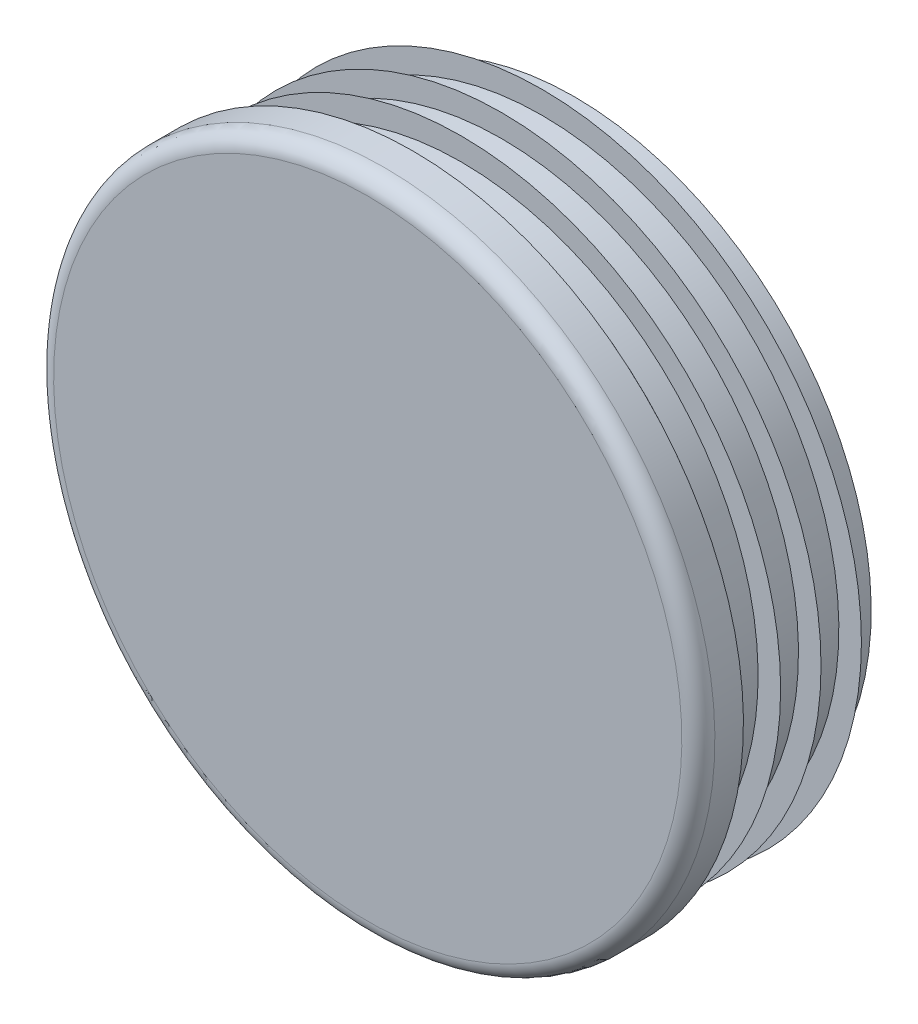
ISO-10303-21;
HEADER;
FILE_DESCRIPTION(('STEP AP214'),'2;1');
FILE_NAME('part.step','',(''),(''),'','','');
FILE_SCHEMA(('AUTOMOTIVE_DESIGN { 1 0 10303 214 1 1 1 1 }'));
ENDSEC;
DATA;
#1=APPLICATION_CONTEXT('core data for automotive mechanical design processes');
#2=APPLICATION_PROTOCOL_DEFINITION('international standard','automotive_design',2000,#1);
#3=PRODUCT_CONTEXT('',#1,'mechanical');
#4=PRODUCT('Part','Part','',(#3));
#5=PRODUCT_RELATED_PRODUCT_CATEGORY('part','',(#4));
#6=PRODUCT_DEFINITION_FORMATION('','',#4);
#7=PRODUCT_DEFINITION_CONTEXT('part definition',#1,'design');
#8=PRODUCT_DEFINITION('design','',#6,#7);
#9=PRODUCT_DEFINITION_SHAPE('','',#8);
#10=(LENGTH_UNIT() NAMED_UNIT(*) SI_UNIT(.MILLI.,.METRE.));
#11=(NAMED_UNIT(*) PLANE_ANGLE_UNIT() SI_UNIT($,.RADIAN.));
#12=(NAMED_UNIT(*) SI_UNIT($,.STERADIAN.) SOLID_ANGLE_UNIT());
#13=UNCERTAINTY_MEASURE_WITH_UNIT(LENGTH_MEASURE(1.E-05),#10,'distance_accuracy_value','');
#14=(GEOMETRIC_REPRESENTATION_CONTEXT(3) GLOBAL_UNCERTAINTY_ASSIGNED_CONTEXT((#13)) GLOBAL_UNIT_ASSIGNED_CONTEXT((#10,
#11,#12)) REPRESENTATION_CONTEXT('',''));
#15=CARTESIAN_POINT('',(0.,0.,0.));
#16=DIRECTION('',(0.,0.,1.));
#17=DIRECTION('',(1.,0.,0.));
#18=AXIS2_PLACEMENT_3D('',#15,#16,#17);
#19=CARTESIAN_POINT('',(0.,0.,6.));
#20=DIRECTION('',(0.,0.,-1.));
#21=DIRECTION('',(0.,1.,0.));
#22=AXIS2_PLACEMENT_3D('',#19,#20,#21);
#23=PLANE('',#22);
#24=CARTESIAN_POINT('',(0.,0.,6.));
#25=DIRECTION('',(0.,0.,-1.));
#26=DIRECTION('',(0.,1.,0.));
#27=AXIS2_PLACEMENT_3D('',#24,#25,#26);
#28=CIRCLE('',#27,41.8);
#29=CARTESIAN_POINT('',(0.,41.8,6.));
#30=VERTEX_POINT('',#29);
#31=EDGE_CURVE('E8',#30,#30,#28,.T.);
#32=ORIENTED_EDGE('',*,*,#31,.F.);
#33=EDGE_LOOP('',(#32));
#34=FACE_BOUND('',#33,.T.);
#35=ADVANCED_FACE('F12',(#34),#23,.F.);
#36=CARTESIAN_POINT('',(0.,0.,3.8));
#37=DIRECTION('',(0.,0.,-1.));
#38=DIRECTION('',(0.,1.,0.));
#39=AXIS2_PLACEMENT_3D('',#36,#37,#38);
#40=TOROIDAL_SURFACE('',#39,41.8,2.2);
#41=ORIENTED_EDGE('',*,*,#31,.T.);
#42=EDGE_LOOP('',(#41));
#43=FACE_BOUND('',#42,.T.);
#44=CARTESIAN_POINT('',(0.,0.,3.80000003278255));
#45=DIRECTION('',(0.,0.,-1.));
#46=DIRECTION('',(0.,1.,0.));
#47=AXIS2_PLACEMENT_3D('',#44,#45,#46);
#48=CIRCLE('',#47,44.);
#49=CARTESIAN_POINT('',(0.,44.,3.80000003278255));
#50=VERTEX_POINT('',#49);
#51=EDGE_CURVE('E18',#50,#50,#48,.T.);
#52=ORIENTED_EDGE('',*,*,#51,.F.);
#53=EDGE_LOOP('',(#52));
#54=FACE_BOUND('',#53,.T.);
#55=ADVANCED_FACE('F159',(#43,#54),#40,.T.);
#56=CARTESIAN_POINT('',(0.,0.,-21.5));
#57=DIRECTION('',(0.,0.,-1.));
#58=DIRECTION('',(0.,1.,0.));
#59=AXIS2_PLACEMENT_3D('',#56,#57,#58);
#60=CYLINDRICAL_SURFACE('',#59,44.);
#61=CARTESIAN_POINT('',(0.,0.,0.));
#62=DIRECTION('',(0.,0.,-1.));
#63=DIRECTION('',(0.,1.,0.));
#64=AXIS2_PLACEMENT_3D('',#61,#62,#63);
#65=CIRCLE('',#64,44.);
#66=CARTESIAN_POINT('',(0.,44.,0.));
#67=VERTEX_POINT('',#66);
#68=EDGE_CURVE('E22',#67,#67,#65,.T.);
#69=ORIENTED_EDGE('',*,*,#68,.F.);
#70=EDGE_LOOP('',(#69));
#71=FACE_BOUND('',#70,.T.);
#72=ORIENTED_EDGE('',*,*,#51,.T.);
#73=EDGE_LOOP('',(#72));
#74=FACE_BOUND('',#73,.T.);
#75=ADVANCED_FACE('F154',(#71,#74),#60,.T.);
#76=CARTESIAN_POINT('',(44.,0.,0.));
#77=DIRECTION('',(0.,0.,1.));
#78=DIRECTION('',(0.,-1.,0.));
#79=AXIS2_PLACEMENT_3D('',#76,#77,#78);
#80=PLANE('',#79);
#81=CARTESIAN_POINT('',(0.,0.,0.));
#82=DIRECTION('',(0.,0.,-1.));
#83=DIRECTION('',(0.,1.,0.));
#84=AXIS2_PLACEMENT_3D('',#81,#82,#83);
#85=CIRCLE('',#84,39.5);
#86=CARTESIAN_POINT('',(0.,39.5,0.));
#87=VERTEX_POINT('',#86);
#88=EDGE_CURVE('E26',#87,#87,#85,.T.);
#89=ORIENTED_EDGE('',*,*,#88,.F.);
#90=EDGE_LOOP('',(#89));
#91=FACE_BOUND('',#90,.T.);
#92=ORIENTED_EDGE('',*,*,#68,.T.);
#93=EDGE_LOOP('',(#92));
#94=FACE_BOUND('',#93,.T.);
#95=ADVANCED_FACE('F148',(#91,#94),#80,.F.);
#96=CARTESIAN_POINT('',(0.,0.,-21.5));
#97=DIRECTION('',(0.,0.,-1.));
#98=DIRECTION('',(0.,1.,0.));
#99=AXIS2_PLACEMENT_3D('',#96,#97,#98);
#100=CYLINDRICAL_SURFACE('',#99,39.5);
#101=CARTESIAN_POINT('',(0.,0.,-1.075));
#102=DIRECTION('',(0.,0.,-1.));
#103=DIRECTION('',(0.,1.,0.));
#104=AXIS2_PLACEMENT_3D('',#101,#102,#103);
#105=CIRCLE('',#104,39.5);
#106=CARTESIAN_POINT('',(0.,39.5,-1.075));
#107=VERTEX_POINT('',#106);
#108=EDGE_CURVE('E31',#107,#107,#105,.T.);
#109=ORIENTED_EDGE('',*,*,#108,.F.);
#110=EDGE_LOOP('',(#109));
#111=FACE_BOUND('',#110,.T.);
#112=ORIENTED_EDGE('',*,*,#88,.T.);
#113=EDGE_LOOP('',(#112));
#114=FACE_BOUND('',#113,.T.);
#115=ADVANCED_FACE('F142',(#111,#114),#100,.T.);
#116=CARTESIAN_POINT('',(39.5,0.,-1.075));
#117=DIRECTION('',(0.,0.,-1.));
#118=DIRECTION('',(0.,1.,0.));
#119=AXIS2_PLACEMENT_3D('',#116,#117,#118);
#120=PLANE('',#119);
#121=CARTESIAN_POINT('',(0.,0.,-1.075));
#122=DIRECTION('',(0.,0.,-1.));
#123=DIRECTION('',(0.,1.,0.));
#124=AXIS2_PLACEMENT_3D('',#121,#122,#123);
#125=CIRCLE('',#124,42.5);
#126=CARTESIAN_POINT('',(0.,42.5,-1.075));
#127=VERTEX_POINT('',#126);
#128=EDGE_CURVE('E34',#127,#127,#125,.T.);
#129=ORIENTED_EDGE('',*,*,#128,.F.);
#130=EDGE_LOOP('',(#129));
#131=FACE_BOUND('',#130,.T.);
#132=ORIENTED_EDGE('',*,*,#108,.T.);
#133=EDGE_LOOP('',(#132));
#134=FACE_BOUND('',#133,.T.);
#135=ADVANCED_FACE('F136',(#131,#134),#120,.F.);
#136=CARTESIAN_POINT('',(0.,0.,-1.075));
#137=DIRECTION('',(0.,0.,1.));
#138=DIRECTION('',(0.,-1.,0.));
#139=AXIS2_PLACEMENT_3D('',#136,#137,#138);
#140=CONICAL_SURFACE('',#139,42.5,0.959931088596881);
#141=CARTESIAN_POINT('',(0.,0.,-3.17562261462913));
#142=DIRECTION('',(0.,0.,-1.));
#143=DIRECTION('',(0.,1.,0.));
#144=AXIS2_PLACEMENT_3D('',#141,#142,#143);
#145=CIRCLE('',#144,39.5);
#146=CARTESIAN_POINT('',(0.,39.5,-3.17562261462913));
#147=VERTEX_POINT('',#146);
#148=EDGE_CURVE('E37',#147,#147,#145,.T.);
#149=ORIENTED_EDGE('',*,*,#148,.F.);
#150=EDGE_LOOP('',(#149));
#151=FACE_BOUND('',#150,.T.);
#152=ORIENTED_EDGE('',*,*,#128,.T.);
#153=EDGE_LOOP('',(#152));
#154=FACE_BOUND('',#153,.T.);
#155=ADVANCED_FACE('F130',(#151,#154),#140,.T.);
#156=CARTESIAN_POINT('',(0.,0.,-21.5));
#157=DIRECTION('',(0.,0.,-1.));
#158=DIRECTION('',(0.,1.,0.));
#159=AXIS2_PLACEMENT_3D('',#156,#157,#158);
#160=CYLINDRICAL_SURFACE('',#159,39.5);
#161=CARTESIAN_POINT('',(0.,0.,-6.45));
#162=DIRECTION('',(0.,0.,-1.));
#163=DIRECTION('',(0.,1.,0.));
#164=AXIS2_PLACEMENT_3D('',#161,#162,#163);
#165=CIRCLE('',#164,39.5);
#166=CARTESIAN_POINT('',(0.,39.5,-6.45));
#167=VERTEX_POINT('',#166);
#168=EDGE_CURVE('E40',#167,#167,#165,.T.);
#169=ORIENTED_EDGE('',*,*,#168,.F.);
#170=EDGE_LOOP('',(#169));
#171=FACE_BOUND('',#170,.T.);
#172=ORIENTED_EDGE('',*,*,#148,.T.);
#173=EDGE_LOOP('',(#172));
#174=FACE_BOUND('',#173,.T.);
#175=ADVANCED_FACE('F124',(#171,#174),#160,.T.);
#176=CARTESIAN_POINT('',(39.5,0.,-6.45));
#177=DIRECTION('',(0.,0.,-1.));
#178=DIRECTION('',(0.,1.,0.));
#179=AXIS2_PLACEMENT_3D('',#176,#177,#178);
#180=PLANE('',#179);
#181=CARTESIAN_POINT('',(0.,0.,-6.45));
#182=DIRECTION('',(0.,0.,-1.));
#183=DIRECTION('',(0.,1.,0.));
#184=AXIS2_PLACEMENT_3D('',#181,#182,#183);
#185=CIRCLE('',#184,42.5);
#186=CARTESIAN_POINT('',(0.,42.5,-6.45));
#187=VERTEX_POINT('',#186);
#188=EDGE_CURVE('E43',#187,#187,#185,.T.);
#189=ORIENTED_EDGE('',*,*,#188,.F.);
#190=EDGE_LOOP('',(#189));
#191=FACE_BOUND('',#190,.T.);
#192=ORIENTED_EDGE('',*,*,#168,.T.);
#193=EDGE_LOOP('',(#192));
#194=FACE_BOUND('',#193,.T.);
#195=ADVANCED_FACE('F118',(#191,#194),#180,.F.);
#196=CARTESIAN_POINT('',(0.,0.,-6.45));
#197=DIRECTION('',(0.,0.,1.));
#198=DIRECTION('',(0.,-1.,0.));
#199=AXIS2_PLACEMENT_3D('',#196,#197,#198);
#200=CONICAL_SURFACE('',#199,42.5,0.959931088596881);
#201=CARTESIAN_POINT('',(0.,0.,-8.55062261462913));
#202=DIRECTION('',(0.,0.,-1.));
#203=DIRECTION('',(0.,1.,0.));
#204=AXIS2_PLACEMENT_3D('',#201,#202,#203);
#205=CIRCLE('',#204,39.5);
#206=CARTESIAN_POINT('',(0.,39.5,-8.55062261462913));
#207=VERTEX_POINT('',#206);
#208=EDGE_CURVE('E46',#207,#207,#205,.T.);
#209=ORIENTED_EDGE('',*,*,#208,.F.);
#210=EDGE_LOOP('',(#209));
#211=FACE_BOUND('',#210,.T.);
#212=ORIENTED_EDGE('',*,*,#188,.T.);
#213=EDGE_LOOP('',(#212));
#214=FACE_BOUND('',#213,.T.);
#215=ADVANCED_FACE('F112',(#211,#214),#200,.T.);
#216=CARTESIAN_POINT('',(0.,0.,-21.5));
#217=DIRECTION('',(0.,0.,-1.));
#218=DIRECTION('',(0.,1.,0.));
#219=AXIS2_PLACEMENT_3D('',#216,#217,#218);
#220=CYLINDRICAL_SURFACE('',#219,39.5);
#221=CARTESIAN_POINT('',(0.,0.,-11.825));
#222=DIRECTION('',(0.,0.,-1.));
#223=DIRECTION('',(0.,1.,0.));
#224=AXIS2_PLACEMENT_3D('',#221,#222,#223);
#225=CIRCLE('',#224,39.5);
#226=CARTESIAN_POINT('',(0.,39.5,-11.825));
#227=VERTEX_POINT('',#226);
#228=EDGE_CURVE('E49',#227,#227,#225,.T.);
#229=ORIENTED_EDGE('',*,*,#228,.F.);
#230=EDGE_LOOP('',(#229));
#231=FACE_BOUND('',#230,.T.);
#232=ORIENTED_EDGE('',*,*,#208,.T.);
#233=EDGE_LOOP('',(#232));
#234=FACE_BOUND('',#233,.T.);
#235=ADVANCED_FACE('F106',(#231,#234),#220,.T.);
#236=CARTESIAN_POINT('',(39.5,0.,-11.825));
#237=DIRECTION('',(0.,0.,-1.));
#238=DIRECTION('',(0.,1.,0.));
#239=AXIS2_PLACEMENT_3D('',#236,#237,#238);
#240=PLANE('',#239);
#241=CARTESIAN_POINT('',(0.,0.,-11.825));
#242=DIRECTION('',(0.,0.,-1.));
#243=DIRECTION('',(0.,1.,0.));
#244=AXIS2_PLACEMENT_3D('',#241,#242,#243);
#245=CIRCLE('',#244,42.5);
#246=CARTESIAN_POINT('',(0.,42.5,-11.825));
#247=VERTEX_POINT('',#246);
#248=EDGE_CURVE('E52',#247,#247,#245,.T.);
#249=ORIENTED_EDGE('',*,*,#248,.F.);
#250=EDGE_LOOP('',(#249));
#251=FACE_BOUND('',#250,.T.);
#252=ORIENTED_EDGE('',*,*,#228,.T.);
#253=EDGE_LOOP('',(#252));
#254=FACE_BOUND('',#253,.T.);
#255=ADVANCED_FACE('F100',(#251,#254),#240,.F.);
#256=CARTESIAN_POINT('',(0.,0.,-11.825));
#257=DIRECTION('',(0.,0.,1.));
#258=DIRECTION('',(0.,-1.,0.));
#259=AXIS2_PLACEMENT_3D('',#256,#257,#258);
#260=CONICAL_SURFACE('',#259,42.5,0.959931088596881);
#261=CARTESIAN_POINT('',(0.,0.,-13.9256226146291));
#262=DIRECTION('',(0.,0.,-1.));
#263=DIRECTION('',(0.,1.,0.));
#264=AXIS2_PLACEMENT_3D('',#261,#262,#263);
#265=CIRCLE('',#264,39.5);
#266=CARTESIAN_POINT('',(0.,39.5,-13.9256226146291));
#267=VERTEX_POINT('',#266);
#268=EDGE_CURVE('E55',#267,#267,#265,.T.);
#269=ORIENTED_EDGE('',*,*,#268,.F.);
#270=EDGE_LOOP('',(#269));
#271=FACE_BOUND('',#270,.T.);
#272=ORIENTED_EDGE('',*,*,#248,.T.);
#273=EDGE_LOOP('',(#272));
#274=FACE_BOUND('',#273,.T.);
#275=ADVANCED_FACE('F94',(#271,#274),#260,.T.);
#276=CARTESIAN_POINT('',(0.,0.,-21.5));
#277=DIRECTION('',(0.,0.,-1.));
#278=DIRECTION('',(0.,1.,0.));
#279=AXIS2_PLACEMENT_3D('',#276,#277,#278);
#280=CYLINDRICAL_SURFACE('',#279,39.5);
#281=CARTESIAN_POINT('',(0.,0.,-17.2));
#282=DIRECTION('',(0.,0.,-1.));
#283=DIRECTION('',(0.,1.,0.));
#284=AXIS2_PLACEMENT_3D('',#281,#282,#283);
#285=CIRCLE('',#284,39.5);
#286=CARTESIAN_POINT('',(0.,39.5,-17.2));
#287=VERTEX_POINT('',#286);
#288=EDGE_CURVE('E58',#287,#287,#285,.T.);
#289=ORIENTED_EDGE('',*,*,#288,.F.);
#290=EDGE_LOOP('',(#289));
#291=FACE_BOUND('',#290,.T.);
#292=ORIENTED_EDGE('',*,*,#268,.T.);
#293=EDGE_LOOP('',(#292));
#294=FACE_BOUND('',#293,.T.);
#295=ADVANCED_FACE('F88',(#291,#294),#280,.T.);
#296=CARTESIAN_POINT('',(39.5,0.,-17.2));
#297=DIRECTION('',(0.,0.,-1.));
#298=DIRECTION('',(0.,1.,0.));
#299=AXIS2_PLACEMENT_3D('',#296,#297,#298);
#300=PLANE('',#299);
#301=CARTESIAN_POINT('',(0.,0.,-17.2));
#302=DIRECTION('',(0.,0.,-1.));
#303=DIRECTION('',(0.,1.,0.));
#304=AXIS2_PLACEMENT_3D('',#301,#302,#303);
#305=CIRCLE('',#304,42.5);
#306=CARTESIAN_POINT('',(0.,42.5,-17.2));
#307=VERTEX_POINT('',#306);
#308=EDGE_CURVE('E61',#307,#307,#305,.T.);
#309=ORIENTED_EDGE('',*,*,#308,.F.);
#310=EDGE_LOOP('',(#309));
#311=FACE_BOUND('',#310,.T.);
#312=ORIENTED_EDGE('',*,*,#288,.T.);
#313=EDGE_LOOP('',(#312));
#314=FACE_BOUND('',#313,.T.);
#315=ADVANCED_FACE('F82',(#311,#314),#300,.F.);
#316=CARTESIAN_POINT('',(0.,0.,-17.2));
#317=DIRECTION('',(0.,0.,1.));
#318=DIRECTION('',(0.,-1.,0.));
#319=AXIS2_PLACEMENT_3D('',#316,#317,#318);
#320=CONICAL_SURFACE('',#319,42.5,0.959931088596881);
#321=CARTESIAN_POINT('',(0.,0.,-19.3006226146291));
#322=DIRECTION('',(0.,0.,-1.));
#323=DIRECTION('',(0.,1.,0.));
#324=AXIS2_PLACEMENT_3D('',#321,#322,#323);
#325=CIRCLE('',#324,39.5);
#326=CARTESIAN_POINT('',(0.,39.5,-19.3006226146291));
#327=VERTEX_POINT('',#326);
#328=EDGE_CURVE('E64',#327,#327,#325,.T.);
#329=ORIENTED_EDGE('',*,*,#328,.F.);
#330=EDGE_LOOP('',(#329));
#331=FACE_BOUND('',#330,.T.);
#332=ORIENTED_EDGE('',*,*,#308,.T.);
#333=EDGE_LOOP('',(#332));
#334=FACE_BOUND('',#333,.T.);
#335=ADVANCED_FACE('F76',(#331,#334),#320,.T.);
#336=CARTESIAN_POINT('',(0.,0.,-21.5));
#337=DIRECTION('',(0.,0.,-1.));
#338=DIRECTION('',(0.,1.,0.));
#339=AXIS2_PLACEMENT_3D('',#336,#337,#338);
#340=CYLINDRICAL_SURFACE('',#339,39.5);
#341=CARTESIAN_POINT('',(0.,0.,-21.5));
#342=DIRECTION('',(0.,0.,-1.));
#343=DIRECTION('',(0.,1.,0.));
#344=AXIS2_PLACEMENT_3D('',#341,#342,#343);
#345=CIRCLE('',#344,39.5);
#346=CARTESIAN_POINT('',(0.,39.5,-21.5));
#347=VERTEX_POINT('',#346);
#348=EDGE_CURVE('E67',#347,#347,#345,.T.);
#349=ORIENTED_EDGE('',*,*,#348,.F.);
#350=EDGE_LOOP('',(#349));
#351=FACE_BOUND('',#350,.T.);
#352=ORIENTED_EDGE('',*,*,#328,.T.);
#353=EDGE_LOOP('',(#352));
#354=FACE_BOUND('',#353,.T.);
#355=ADVANCED_FACE('F73',(#351,#354),#340,.T.);
#356=CARTESIAN_POINT('',(39.5,0.,-21.5));
#357=DIRECTION('',(0.,0.,1.));
#358=DIRECTION('',(0.,-1.,0.));
#359=AXIS2_PLACEMENT_3D('',#356,#357,#358);
#360=PLANE('',#359);
#361=ORIENTED_EDGE('',*,*,#348,.T.);
#362=EDGE_LOOP('',(#361));
#363=FACE_BOUND('',#362,.T.);
#364=ADVANCED_FACE('F71',(#363),#360,.F.);
#365=CLOSED_SHELL('',(#35,#55,#75,#95,#115,#135,#155,#175,#195,#215,#235,#255,#275,#295,#315,
#335,#355,#364));
#366=MANIFOLD_SOLID_BREP('B1',#365);
#367=ADVANCED_BREP_SHAPE_REPRESENTATION('',(#18,#366),#14);
#368=SHAPE_DEFINITION_REPRESENTATION(#9,#367);
ENDSEC;
END-ISO-10303-21;
